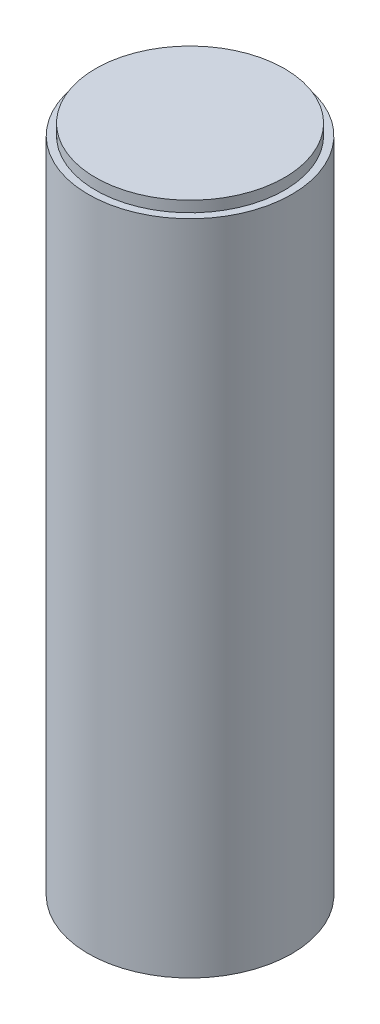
ISO-10303-21;
HEADER;
FILE_DESCRIPTION(('STEP AP214'),'2;1');
FILE_NAME('part.step','',(''),(''),'','','');
FILE_SCHEMA(('AUTOMOTIVE_DESIGN { 1 0 10303 214 1 1 1 1 }'));
ENDSEC;
DATA;
#1=APPLICATION_CONTEXT('core data for automotive mechanical design processes');
#2=APPLICATION_PROTOCOL_DEFINITION('international standard','automotive_design',2000,#1);
#3=PRODUCT_CONTEXT('',#1,'mechanical');
#4=PRODUCT('Part','Part','',(#3));
#5=PRODUCT_RELATED_PRODUCT_CATEGORY('part','',(#4));
#6=PRODUCT_DEFINITION_FORMATION('','',#4);
#7=PRODUCT_DEFINITION_CONTEXT('part definition',#1,'design');
#8=PRODUCT_DEFINITION('design','',#6,#7);
#9=PRODUCT_DEFINITION_SHAPE('','',#8);
#10=(LENGTH_UNIT() NAMED_UNIT(*) SI_UNIT(.MILLI.,.METRE.));
#11=(NAMED_UNIT(*) PLANE_ANGLE_UNIT() SI_UNIT($,.RADIAN.));
#12=(NAMED_UNIT(*) SI_UNIT($,.STERADIAN.) SOLID_ANGLE_UNIT());
#13=UNCERTAINTY_MEASURE_WITH_UNIT(LENGTH_MEASURE(1.E-05),#10,'distance_accuracy_value','');
#14=(GEOMETRIC_REPRESENTATION_CONTEXT(3) GLOBAL_UNCERTAINTY_ASSIGNED_CONTEXT((#13)) GLOBAL_UNIT_ASSIGNED_CONTEXT((#10,
#11,#12)) REPRESENTATION_CONTEXT('',''));
#15=CARTESIAN_POINT('',(0.,0.,0.));
#16=DIRECTION('',(0.,0.,1.));
#17=DIRECTION('',(1.,0.,0.));
#18=AXIS2_PLACEMENT_3D('',#15,#16,#17);
#19=CARTESIAN_POINT('',(0.,180.5,0.));
#20=DIRECTION('',(0.,1.,0.));
#21=DIRECTION('',(-1.,0.,0.));
#22=AXIS2_PLACEMENT_3D('',#19,#20,#21);
#23=PLANE('',#22);
#24=CARTESIAN_POINT('',(0.,180.5,0.));
#25=DIRECTION('',(0.,-1.,0.));
#26=DIRECTION('',(0.,0.,-1.));
#27=AXIS2_PLACEMENT_3D('',#24,#25,#26);
#28=CIRCLE('',#27,26.);
#29=CARTESIAN_POINT('',(0.,180.5,-26.));
#30=VERTEX_POINT('',#29);
#31=EDGE_CURVE('E120',#30,#30,#28,.T.);
#32=ORIENTED_EDGE('',*,*,#31,.F.);
#33=EDGE_LOOP('',(#32));
#34=FACE_BOUND('',#33,.T.);
#35=ADVANCED_FACE('F16',(#34),#23,.T.);
#36=CARTESIAN_POINT('',(0.,180.5,0.));
#37=DIRECTION('',(0.,-1.,0.));
#38=DIRECTION('',(0.,0.,-1.));
#39=AXIS2_PLACEMENT_3D('',#36,#37,#38);
#40=CYLINDRICAL_SURFACE('',#39,26.);
#41=CARTESIAN_POINT('',(0.,177.5,0.));
#42=DIRECTION('',(0.,-1.,0.));
#43=DIRECTION('',(0.,0.,-1.));
#44=AXIS2_PLACEMENT_3D('',#41,#42,#43);
#45=CIRCLE('',#44,26.);
#46=CARTESIAN_POINT('',(0.,177.5,-26.));
#47=VERTEX_POINT('',#46);
#48=EDGE_CURVE('E115',#47,#47,#45,.T.);
#49=ORIENTED_EDGE('',*,*,#48,.F.);
#50=EDGE_LOOP('',(#49));
#51=FACE_BOUND('',#50,.T.);
#52=ORIENTED_EDGE('',*,*,#31,.T.);
#53=EDGE_LOOP('',(#52));
#54=FACE_BOUND('',#53,.T.);
#55=ADVANCED_FACE('F125',(#51,#54),#40,.T.);
#56=CARTESIAN_POINT('',(0.,177.5,0.));
#57=DIRECTION('',(0.,1.,0.));
#58=DIRECTION('',(-1.,0.,0.));
#59=AXIS2_PLACEMENT_3D('',#56,#57,#58);
#60=PLANE('',#59);
#61=ORIENTED_EDGE('',*,*,#48,.T.);
#62=EDGE_LOOP('',(#61));
#63=FACE_BOUND('',#62,.T.);
#64=CARTESIAN_POINT('',(0.,177.5,0.));
#65=DIRECTION('',(0.,-1.,0.));
#66=DIRECTION('',(1.,0.,0.));
#67=AXIS2_PLACEMENT_3D('',#64,#65,#66);
#68=CIRCLE('',#67,28.);
#69=CARTESIAN_POINT('',(28.0000000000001,177.5,0.));
#70=VERTEX_POINT('',#69);
#71=EDGE_CURVE('E110',#70,#70,#68,.T.);
#72=ORIENTED_EDGE('',*,*,#71,.F.);
#73=EDGE_LOOP('',(#72));
#74=FACE_BOUND('',#73,.T.);
#75=ADVANCED_FACE('F133',(#63,#74),#60,.T.);
#76=CARTESIAN_POINT('',(0.,177.5,0.));
#77=DIRECTION('',(0.,-1.,0.));
#78=DIRECTION('',(1.,0.,0.));
#79=AXIS2_PLACEMENT_3D('',#76,#77,#78);
#80=CYLINDRICAL_SURFACE('',#79,28.);
#81=ORIENTED_EDGE('',*,*,#71,.T.);
#82=EDGE_LOOP('',(#81));
#83=FACE_BOUND('',#82,.T.);
#84=CARTESIAN_POINT('',(0.,-3.5,0.));
#85=DIRECTION('',(0.,-1.,0.));
#86=DIRECTION('',(1.,0.,0.));
#87=AXIS2_PLACEMENT_3D('',#84,#85,#86);
#88=CIRCLE('',#87,28.);
#89=CARTESIAN_POINT('',(28.,-3.50000000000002,0.));
#90=VERTEX_POINT('',#89);
#91=EDGE_CURVE('E101',#90,#90,#88,.T.);
#92=ORIENTED_EDGE('',*,*,#91,.F.);
#93=EDGE_LOOP('',(#92));
#94=FACE_BOUND('',#93,.T.);
#95=ADVANCED_FACE('F155',(#83,#94),#80,.T.);
#96=CARTESIAN_POINT('',(0.,-3.5,0.));
#97=DIRECTION('',(0.,-1.,0.));
#98=DIRECTION('',(1.,0.,0.));
#99=AXIS2_PLACEMENT_3D('',#96,#97,#98);
#100=PLANE('',#99);
#101=DIRECTION('',(0.,0.,1.));
#102=VECTOR('',#101,1.);
#103=CARTESIAN_POINT('',(-6.,-3.5,-11.65));
#104=LINE('',#103,#102);
#105=CARTESIAN_POINT('',(-6.,-3.5,-19.0787840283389));
#106=VERTEX_POINT('',#105);
#107=CARTESIAN_POINT('',(-5.99999999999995,-3.5,-23.3));
#108=VERTEX_POINT('',#107);
#109=EDGE_CURVE('E53',#106,#108,#104,.F.);
#110=ORIENTED_EDGE('',*,*,#109,.F.);
#111=CARTESIAN_POINT('',(0.,-3.5,0.));
#112=DIRECTION('',(0.,-1.,0.));
#113=DIRECTION('',(1.,0.,0.));
#114=AXIS2_PLACEMENT_3D('',#111,#112,#113);
#115=CIRCLE('',#114,20.);
#116=CARTESIAN_POINT('',(6.,-3.5,-19.0787840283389));
#117=VERTEX_POINT('',#116);
#118=EDGE_CURVE('E79',#106,#117,#115,.F.);
#119=ORIENTED_EDGE('',*,*,#118,.T.);
#120=DIRECTION('',(0.,0.,1.));
#121=VECTOR('',#120,1.);
#122=CARTESIAN_POINT('',(6.,-3.5,-11.65));
#123=LINE('',#122,#121);
#124=CARTESIAN_POINT('',(6.,-3.5,-23.3));
#125=VERTEX_POINT('',#124);
#126=EDGE_CURVE('E89',#125,#117,#123,.T.);
#127=ORIENTED_EDGE('',*,*,#126,.F.);
#128=DIRECTION('',(1.,0.,0.));
#129=VECTOR('',#128,1.);
#130=CARTESIAN_POINT('',(0.,-3.5,-23.3));
#131=LINE('',#130,#129);
#132=EDGE_CURVE('E59',#108,#125,#131,.T.);
#133=ORIENTED_EDGE('',*,*,#132,.F.);
#134=EDGE_LOOP('',(#110,#119,#127,#133));
#135=FACE_BOUND('',#134,.T.);
#136=ORIENTED_EDGE('',*,*,#91,.T.);
#137=EDGE_LOOP('',(#136));
#138=FACE_BOUND('',#137,.T.);
#139=ADVANCED_FACE('F152',(#135,#138),#100,.T.);
#140=CARTESIAN_POINT('',(-5.99999999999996,88.5,-11.65));
#141=DIRECTION('',(1.,0.,0.));
#142=DIRECTION('',(0.,1.,0.));
#143=AXIS2_PLACEMENT_3D('',#140,#141,#142);
#144=PLANE('',#143);
#145=ORIENTED_EDGE('',*,*,#109,.T.);
#146=DIRECTION('',(0.,1.,0.));
#147=VECTOR('',#146,1.);
#148=CARTESIAN_POINT('',(-5.99999999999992,88.5,-23.3));
#149=LINE('',#148,#147);
#150=CARTESIAN_POINT('',(-5.99999999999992,177.5,-23.3));
#151=VERTEX_POINT('',#150);
#152=EDGE_CURVE('E63',#151,#108,#149,.F.);
#153=ORIENTED_EDGE('',*,*,#152,.F.);
#154=DIRECTION('',(0.,0.,1.));
#155=VECTOR('',#154,1.);
#156=CARTESIAN_POINT('',(-5.99999999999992,177.5,0.));
#157=LINE('',#156,#155);
#158=CARTESIAN_POINT('',(-5.99999999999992,177.5,-19.0787840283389));
#159=VERTEX_POINT('',#158);
#160=EDGE_CURVE('E67',#159,#151,#157,.F.);
#161=ORIENTED_EDGE('',*,*,#160,.F.);
#162=DIRECTION('',(0.,-1.,0.));
#163=VECTOR('',#162,1.);
#164=CARTESIAN_POINT('',(-5.99999999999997,88.5,-19.0787840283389));
#165=LINE('',#164,#163);
#166=EDGE_CURVE('E87',#159,#106,#165,.T.);
#167=ORIENTED_EDGE('',*,*,#166,.T.);
#168=EDGE_LOOP('',(#145,#153,#161,#167));
#169=FACE_BOUND('',#168,.T.);
#170=ADVANCED_FACE('F65',(#169),#144,.T.);
#171=CARTESIAN_POINT('',(0.,88.5,-23.3));
#172=DIRECTION('',(0.,0.,1.));
#173=DIRECTION('',(1.,0.,0.));
#174=AXIS2_PLACEMENT_3D('',#171,#172,#173);
#175=PLANE('',#174);
#176=ORIENTED_EDGE('',*,*,#132,.T.);
#177=DIRECTION('',(0.,-1.,0.));
#178=VECTOR('',#177,1.);
#179=CARTESIAN_POINT('',(6.00000000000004,88.5,-23.3));
#180=LINE('',#179,#178);
#181=CARTESIAN_POINT('',(6.00000000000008,177.5,-23.3));
#182=VERTEX_POINT('',#181);
#183=EDGE_CURVE('E74',#182,#125,#180,.T.);
#184=ORIENTED_EDGE('',*,*,#183,.F.);
#185=DIRECTION('',(1.,0.,0.));
#186=VECTOR('',#185,1.);
#187=CARTESIAN_POINT('',(0.,177.5,-23.3));
#188=LINE('',#187,#186);
#189=EDGE_CURVE('E71',#151,#182,#188,.T.);
#190=ORIENTED_EDGE('',*,*,#189,.F.);
#191=ORIENTED_EDGE('',*,*,#152,.T.);
#192=EDGE_LOOP('',(#176,#184,#190,#191));
#193=FACE_BOUND('',#192,.T.);
#194=ADVANCED_FACE('F72',(#193),#175,.T.);
#195=CARTESIAN_POINT('',(6.00000000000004,88.5,-11.65));
#196=DIRECTION('',(-1.,0.,0.));
#197=DIRECTION('',(0.,-1.,0.));
#198=AXIS2_PLACEMENT_3D('',#195,#196,#197);
#199=PLANE('',#198);
#200=ORIENTED_EDGE('',*,*,#126,.T.);
#201=DIRECTION('',(0.,-1.,0.));
#202=VECTOR('',#201,1.);
#203=CARTESIAN_POINT('',(6.00000000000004,88.5,-19.0787840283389));
#204=LINE('',#203,#202);
#205=CARTESIAN_POINT('',(6.00000000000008,177.5,-19.0787840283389));
#206=VERTEX_POINT('',#205);
#207=EDGE_CURVE('E35',#117,#206,#204,.F.);
#208=ORIENTED_EDGE('',*,*,#207,.T.);
#209=DIRECTION('',(0.,0.,1.));
#210=VECTOR('',#209,1.);
#211=CARTESIAN_POINT('',(6.00000000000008,177.5,0.));
#212=LINE('',#211,#210);
#213=EDGE_CURVE('E26',#182,#206,#212,.T.);
#214=ORIENTED_EDGE('',*,*,#213,.F.);
#215=ORIENTED_EDGE('',*,*,#183,.T.);
#216=EDGE_LOOP('',(#200,#208,#214,#215));
#217=FACE_BOUND('',#216,.T.);
#218=ADVANCED_FACE('F141',(#217),#199,.T.);
#219=CARTESIAN_POINT('',(0.,177.5,0.));
#220=DIRECTION('',(0.,-1.,0.));
#221=DIRECTION('',(1.,0.,0.));
#222=AXIS2_PLACEMENT_3D('',#219,#220,#221);
#223=CYLINDRICAL_SURFACE('',#222,20.);
#224=ORIENTED_EDGE('',*,*,#207,.F.);
#225=ORIENTED_EDGE('',*,*,#118,.F.);
#226=ORIENTED_EDGE('',*,*,#166,.F.);
#227=CARTESIAN_POINT('',(0.,177.5,0.));
#228=DIRECTION('',(0.,-1.,0.));
#229=DIRECTION('',(1.,0.,0.));
#230=AXIS2_PLACEMENT_3D('',#227,#228,#229);
#231=CIRCLE('',#230,20.);
#232=EDGE_CURVE('E11',#206,#159,#231,.T.);
#233=ORIENTED_EDGE('',*,*,#232,.F.);
#234=EDGE_LOOP('',(#224,#225,#226,#233));
#235=FACE_BOUND('',#234,.T.);
#236=ADVANCED_FACE('F137',(#235),#223,.F.);
#237=CARTESIAN_POINT('',(0.,177.5,0.));
#238=DIRECTION('',(0.,-1.,0.));
#239=DIRECTION('',(1.,0.,0.));
#240=AXIS2_PLACEMENT_3D('',#237,#238,#239);
#241=PLANE('',#240);
#242=ORIENTED_EDGE('',*,*,#213,.T.);
#243=ORIENTED_EDGE('',*,*,#232,.T.);
#244=ORIENTED_EDGE('',*,*,#160,.T.);
#245=ORIENTED_EDGE('',*,*,#189,.T.);
#246=EDGE_LOOP('',(#242,#243,#244,#245));
#247=FACE_BOUND('',#246,.T.);
#248=ADVANCED_FACE('F18',(#247),#241,.T.);
#249=CLOSED_SHELL('',(#35,#55,#75,#95,#139,#170,#194,#218,#236,#248));
#250=MANIFOLD_SOLID_BREP('B1',#249);
#251=ADVANCED_BREP_SHAPE_REPRESENTATION('',(#18,#250),#14);
#252=SHAPE_DEFINITION_REPRESENTATION(#9,#251);
ENDSEC;
END-ISO-10303-21;
